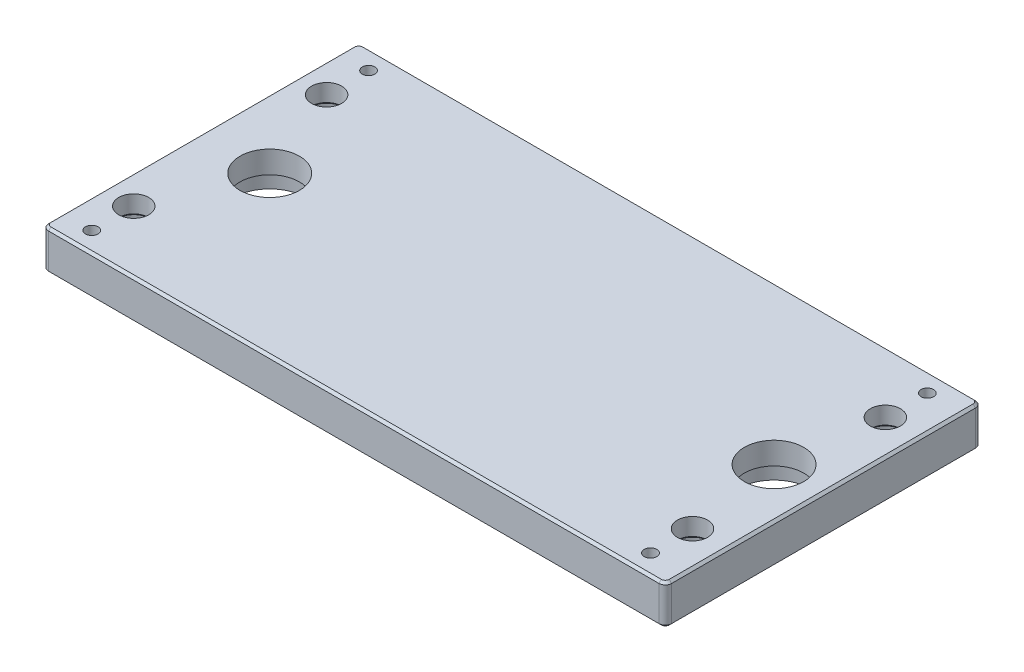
from build123d import *

# Parameters (mm, degrees)
SKETCH1_W                                        = 200.025
SKETCH1_H                                        = 101.6
BOSS_EXTRUDE1_DEPTH                              = 12.7
F_10_32_TAPPED_HOLE1_D                           = 4.0386
CBORE_FOR_1_4_SOCKET_HEAD_CAP_SCREW1_D           = 19.0754
CBORE_FOR_1_4_SOCKET_HEAD_CAP_SCREW1_DEPTH       = 17.4244
CBORE_FOR_1_4_SOCKET_HEAD_CAP_SCREW1_CBORE_D     = 23.622
CBORE_FOR_1_4_SOCKET_HEAD_CAP_SCREW1_CBORE_DEPTH = 5.5372
CBORE_FOR_1_4_SOCKET_HEAD_CAP_SCREW2_D           = 9.652
CBORE_FOR_1_4_SOCKET_HEAD_CAP_SCREW2_DEPTH       = 17.4244
CBORE_FOR_1_4_SOCKET_HEAD_CAP_SCREW2_CBORE_D     = 16.256
CBORE_FOR_1_4_SOCKET_HEAD_CAP_SCREW2_CBORE_DEPTH = 6.3754
FILLET1_R                                        = 2.032
CHAMFER1_SIZE                                    = 0.762
CHAMFER2_SIZE                                    = 0.762
CUT_EXTRUDE1_DEPTH                               = 0.0508


with BuildPart() as part:
    # Sketch1 → Boss-Extrude1 (new body)
    with BuildSketch(Plane(origin=(0, 0, 0), x_dir=(1, 0, 0), z_dir=(0, 1, 0))):
        with Locations((1.5875, 0)):
            Rectangle(SKETCH1_W, SKETCH1_H)
    extrude(amount=BOSS_EXTRUDE1_DEPTH)

    # 10-32 Tapped Hole1 (through all)
    with Locations(Plane(origin=(0, 0, 0), x_dir=(-1, 0, 0), z_dir=(0, -1, 0))):
        with Locations((88.9, -44.45), (-90.5002, -44.45), (-90.5002, 44.45), (88.9, 44.45)):
            Hole(F_10_32_TAPPED_HOLE1_D / 2)

    # CBORE for 1_4 Socket Head Cap Screw1
    with Locations(Plane(origin=(0, 0, 0), x_dir=(-1, 0, 0), z_dir=(0, -1, 0))):
        with Locations((76.2, 0), (-85.725, 0)):
            CounterBoreHole(CBORE_FOR_1_4_SOCKET_HEAD_CAP_SCREW1_D / 2, CBORE_FOR_1_4_SOCKET_HEAD_CAP_SCREW1_CBORE_D / 2, CBORE_FOR_1_4_SOCKET_HEAD_CAP_SCREW1_CBORE_DEPTH, depth=CBORE_FOR_1_4_SOCKET_HEAD_CAP_SCREW1_DEPTH)

    # CBORE for 1_4 Socket Head Cap Screw2
    with Locations(Plane(origin=(0, 0, 0), x_dir=(-1, 0, 0), z_dir=(0, -1, 0))):
        with Locations((88.9, -30.9626), (-90.5002, -30.9626), (-90.5002, 30.9626), (88.9, 30.9626)):
            CounterBoreHole(CBORE_FOR_1_4_SOCKET_HEAD_CAP_SCREW2_D / 2, CBORE_FOR_1_4_SOCKET_HEAD_CAP_SCREW2_CBORE_D / 2, CBORE_FOR_1_4_SOCKET_HEAD_CAP_SCREW2_CBORE_DEPTH, depth=CBORE_FOR_1_4_SOCKET_HEAD_CAP_SCREW2_DEPTH)

    # Fillet1
    fillet1_edges = [part.edges().sort_by_distance(p)[0] for p in [
        (-98.425, 6.35, -50.8),
        (101.6, 6.35, -50.8),
        (101.6, 6.35, 50.8),
        (-98.425, 6.35, 50.8),
    ]]
    fillet(fillet1_edges, radius=FILLET1_R)

    # Chamfer1
    chamfer1_edges = [part.edges().sort_by_distance(p)[0] for p in [
        (1.5875, 0, 50.8),
        (1.5875, 12.7, 50.8),
        (-98.425, 0, 0),
        (1.5875, 0, -50.8),
        (101.6, 0, 0),
        (101.004840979, 0, 50.204840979),
        (101.004840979, 0, -50.204840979),
        (-97.829840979, 0, -50.204840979),
        (-97.829840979, 0, 50.204840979),
        (-98.425, 12.7, 0),
        (101.6, 12.7, 0),
        (1.5875, 12.7, -50.8),
        (101.004840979, 12.7, 50.204840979),
        (101.004840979, 12.7, -50.204840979),
        (-97.829840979, 12.7, -50.204840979),
        (-97.829840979, 12.7, 50.204840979),
    ]]
    chamfer(chamfer1_edges, length=CHAMFER1_SIZE)

    # Chamfer2
    chamfer2_edges = [part.edges().sort_by_distance(p)[0] for p in [
        (-90.9193, 0, -44.45),
        (88.4809, 0, -44.45),
        (88.4809, 0, 44.45),
        (-90.9193, 0, 44.45),
        (-93.726, 6.3754, -30.9626),
        (85.6742, 6.3754, -30.9626),
        (85.6742, 6.3754, 30.9626),
        (-93.726, 6.3754, 30.9626),
    ]]
    chamfer(chamfer2_edges, length=CHAMFER2_SIZE)

    # Sketch10 → Cut-Extrude1 (cut)
    with BuildSketch(Plane(origin=(0, 0, -50.8), x_dir=(-1, 0, 0), z_dir=(0, 0, -1))):
        with BuildLine():
            add(Edge.make_bspline(
                [(91.323497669, 8.287673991), (91.323944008, 8.364006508), (91.324811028, 8.512283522), (91.334456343, 8.728344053), (91.35047922, 8.931036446), (91.372437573, 9.120370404), (91.399159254, 9.296394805), (91.434831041, 9.458639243), (91.475397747, 9.607854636), (91.522413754, 9.744527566), (91.575464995, 9.870499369), (91.6332059, 9.988099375), (91.697927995, 10.097149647), (91.765932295, 10.199390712), (91.839971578, 10.293148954), (91.917938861, 10.379748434), (92.002877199, 10.457187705), (92.091899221, 10.52773571), (92.18581091, 10.589579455), (92.281935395, 10.644052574), (92.380934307, 10.690588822), (92.483077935, 10.727179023), (92.587448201, 10.757401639), (92.69440996, 10.778069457), (92.804139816, 10.791073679), (92.878205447, 10.79231692), (92.915767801, 10.792947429)],
                knots=[0, 0, 0, 0, 1.646270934, 3.197905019, 4.663502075, 6.030701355, 7.308322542, 8.50163776, 9.611534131, 10.641858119, 11.616356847, 12.558055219, 13.465016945, 14.349605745, 15.204443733, 16.039544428, 16.859896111, 17.680448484, 18.487036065, 19.28249412, 20.06191084, 20.843045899, 21.620316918, 22.403196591, 23.190181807, 24, 24, 24, 24], degree=3))
            add(Edge.make_bspline(
                [(92.915767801, 10.792947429), (92.953643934, 10.792283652), (93.028967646, 10.790963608), (93.140329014, 10.778276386), (93.249117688, 10.757224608), (93.35486987, 10.727396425), (93.458454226, 10.690390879), (93.559060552, 10.644008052), (93.65731376, 10.59001645), (93.751652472, 10.526574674), (93.84311236, 10.455841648), (93.929446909, 10.375882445), (94.01066398, 10.287504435), (94.087782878, 10.191653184), (94.158615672, 10.086490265), (94.22607095, 9.973844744), (94.286448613, 9.851746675), (94.344598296, 9.722233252), (94.394790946, 9.581720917), (94.440056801, 9.431001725), (94.476631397, 9.26829542), (94.5070968, 9.094455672), (94.530698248, 8.908844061), (94.547887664, 8.711858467), (94.556967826, 8.503369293), (94.558677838, 8.360823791), (94.559555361, 8.287673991)],
                knots=[0, 0, 0, 0, 0.810914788, 1.612654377, 2.396697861, 3.181598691, 3.963628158, 4.749916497, 5.551656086, 6.361998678, 7.18212741, 8.025565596, 8.878627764, 9.750805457, 10.657531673, 11.591944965, 12.560506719, 13.57287815, 14.630710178, 15.753379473, 16.941251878, 18.199788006, 19.531962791, 20.947069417, 22.433333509, 24, 24, 24, 24], degree=3))
            add(Edge.make_bspline(
                [(94.559555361, 8.287673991), (94.558668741, 8.214843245), (94.556941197, 8.072935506), (94.547989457, 7.865384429), (94.530356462, 7.669444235), (94.508299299, 7.484644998), (94.477749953, 7.311755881), (94.440187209, 7.150178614), (94.398480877, 6.99921543), (94.346998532, 6.860103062), (94.290650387, 6.730900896), (94.229343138, 6.610250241), (94.163661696, 6.497084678), (94.09210344, 6.392310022), (94.015830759, 6.295184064), (93.933211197, 6.207421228), (93.846573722, 6.126906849), (93.754844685, 6.055263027), (93.659034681, 5.992554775), (93.561118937, 5.9364745), (93.459360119, 5.891254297), (93.35606428, 5.852426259), (93.249753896, 5.822762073), (93.140561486, 5.802250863), (93.029042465, 5.787865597), (92.953656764, 5.786768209), (92.915767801, 5.78621666)],
                knots=[0, 0, 0, 0, 1.561518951, 3.042555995, 4.452378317, 5.7783523, 7.031515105, 8.214008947, 9.334062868, 10.386615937, 11.391082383, 12.354592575, 13.286541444, 14.194233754, 15.072674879, 15.931287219, 16.775624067, 17.606195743, 18.42308326, 19.229000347, 20.022332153, 20.807536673, 21.593273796, 22.3848459, 23.188221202, 24, 24, 24, 24], degree=3))
            add(Edge.make_bspline(
                [(92.915767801, 5.78621666), (92.878206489, 5.786851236), (92.804142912, 5.788102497), (92.694398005, 5.801047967), (92.587877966, 5.821860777), (92.484057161, 5.851002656), (92.382402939, 5.886673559), (92.284300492, 5.933146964), (92.188659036, 5.986669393), (92.095733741, 6.047623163), (92.007270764, 6.117457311), (91.922772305, 6.194697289), (91.844361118, 6.281270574), (91.771380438, 6.375810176), (91.702019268, 6.477446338), (91.638216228, 6.587566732), (91.579200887, 6.705734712), (91.525257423, 6.832713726), (91.477430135, 6.970356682), (91.435183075, 7.120238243), (91.40182631, 7.283681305), (91.373274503, 7.459373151), (91.350245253, 7.648068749), (91.334523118, 7.84987054), (91.324805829, 8.06465277), (91.323941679, 8.211976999), (91.323497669, 8.287673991)],
                knots=[0, 0, 0, 0, 0.810891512, 1.598919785, 2.382837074, 3.152667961, 3.926044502, 4.706494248, 5.493654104, 6.291793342, 7.103789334, 7.925228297, 8.761435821, 9.622817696, 10.50288917, 11.416980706, 12.369136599, 13.353924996, 14.394355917, 15.514179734, 16.714354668, 17.994756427, 19.357759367, 20.818452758, 22.365282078, 24, 24, 24, 24], degree=3))
        make_face()
        with BuildLine():
            add(Edge.make_bspline(
                [(91.750901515, 8.289582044), (91.751064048, 8.225970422), (91.751379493, 8.102512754), (91.759620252, 7.923111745), (91.770846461, 7.755784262), (91.785326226, 7.600317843), (91.806829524, 7.457238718), (91.830923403, 7.325562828), (91.860244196, 7.205987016), (91.894935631, 7.097690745), (91.934449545, 6.99883612), (91.977592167, 6.906850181), (92.023939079, 6.820646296), (92.075808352, 6.740998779), (92.132298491, 6.667647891), (92.192133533, 6.599295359), (92.257546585, 6.538339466), (92.348039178, 6.465232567), (92.467505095, 6.389686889), (92.618027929, 6.323901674), (92.772698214, 6.282559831), (92.877679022, 6.277302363), (92.930078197, 6.274678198)],
                knots=[0, 0, 0, 0, 1.459021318, 2.831673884, 4.118529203, 5.306027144, 6.411944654, 7.436330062, 8.375795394, 9.233974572, 10.042671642, 10.816086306, 11.563610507, 12.285937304, 12.993564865, 13.685989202, 14.367179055, 15.041617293, 16.353048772, 17.594441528, 18.799311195, 20, 20, 20, 20], degree=3))
            add(Edge.make_bspline(
                [(92.930078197, 6.274678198), (92.982816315, 6.276852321), (93.088183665, 6.281196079), (93.242126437, 6.323104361), (93.391574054, 6.386336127), (93.508693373, 6.461103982), (93.597796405, 6.532307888), (93.661637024, 6.593015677), (93.720232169, 6.66099134), (93.775806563, 6.734332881), (93.826777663, 6.814441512), (93.873127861, 6.900932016), (93.915423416, 6.994044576), (93.939520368, 7.059045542), (93.951840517, 7.092278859)],
                knots=[0, 0, 0, 0, 1.353760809, 2.704726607, 4.075137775, 5.516104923, 6.260822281, 7.007110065, 7.778089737, 8.566572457, 9.372053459, 10.217411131, 11.088608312, 12, 12, 12, 12], degree=3))
            add(Edge.make_bspline(
                [(93.951840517, 7.092278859), (93.966198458, 7.134773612), (93.995351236, 7.221056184), (94.032922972, 7.35490101), (94.062512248, 7.495330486), (94.089132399, 7.641505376), (94.107302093, 7.794503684), (94.121926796, 7.953852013), (94.130541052, 8.11967051), (94.131608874, 8.232330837), (94.132151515, 8.289582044)],
                knots=[0, 0, 0, 0, 0.884706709, 1.796334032, 2.740027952, 3.714592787, 4.726048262, 5.777819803, 6.87074269, 8, 8, 8, 8], degree=3))
            add(Edge.make_bspline(
                [(94.132151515, 8.289582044), (94.131402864, 8.346823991), (94.129938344, 8.458801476), (94.124340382, 8.622792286), (94.109884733, 8.778550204), (94.093829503, 8.92674624), (94.070156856, 9.066560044), (94.04463284, 9.199162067), (94.010341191, 9.32290954), (93.973711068, 9.439739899), (93.931786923, 9.54832579), (93.885637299, 9.649173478), (93.836349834, 9.742769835), (93.782816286, 9.828858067), (93.72567216, 9.907823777), (93.663409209, 9.978083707), (93.598497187, 10.041815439), (93.507578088, 10.11456272), (93.388550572, 10.188737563), (93.240442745, 10.256998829), (93.086313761, 10.296198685), (92.982119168, 10.30172548), (92.930078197, 10.30448589)],
                knots=[0, 0, 0, 0, 1.31362396, 2.569729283, 3.763502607, 4.902122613, 5.988968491, 7.01645872, 7.998833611, 8.933434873, 9.825090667, 10.667526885, 11.477055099, 12.250526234, 12.991942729, 13.710640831, 14.402115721, 15.076753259, 16.378508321, 17.609869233, 18.806226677, 20, 20, 20, 20], degree=3))
            add(Edge.make_bspline(
                [(92.930078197, 10.30448589), (92.877404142, 10.301721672), (92.771960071, 10.296188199), (92.616229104, 10.257144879), (92.466952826, 10.189091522), (92.348240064, 10.114317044), (92.257257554, 10.043099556), (92.193191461, 9.981341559), (92.133121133, 9.913787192), (92.077784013, 9.839761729), (92.025955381, 9.760207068), (91.978356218, 9.674497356), (91.935470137, 9.58219825), (91.895894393, 9.483388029), (91.861097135, 9.375101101), (91.832394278, 9.255672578), (91.805877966, 9.124415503), (91.787106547, 8.980561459), (91.770419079, 8.8250561), (91.759694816, 8.657310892), (91.751351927, 8.477609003), (91.751054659, 8.353513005), (91.750901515, 8.289582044)],
                knots=[0, 0, 0, 0, 1.207732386, 2.417664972, 3.655092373, 4.956220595, 5.625982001, 6.301752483, 6.994047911, 7.697131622, 8.419323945, 9.170223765, 9.943494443, 10.752040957, 11.610060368, 12.549350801, 13.567764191, 14.679664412, 15.874934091, 17.154273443, 18.533957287, 20, 20, 20, 20], degree=3))
        make_face(mode=Mode.SUBTRACT)
    extrude(amount=-CUT_EXTRUDE1_DEPTH, mode=Mode.SUBTRACT)


solid = part.part
